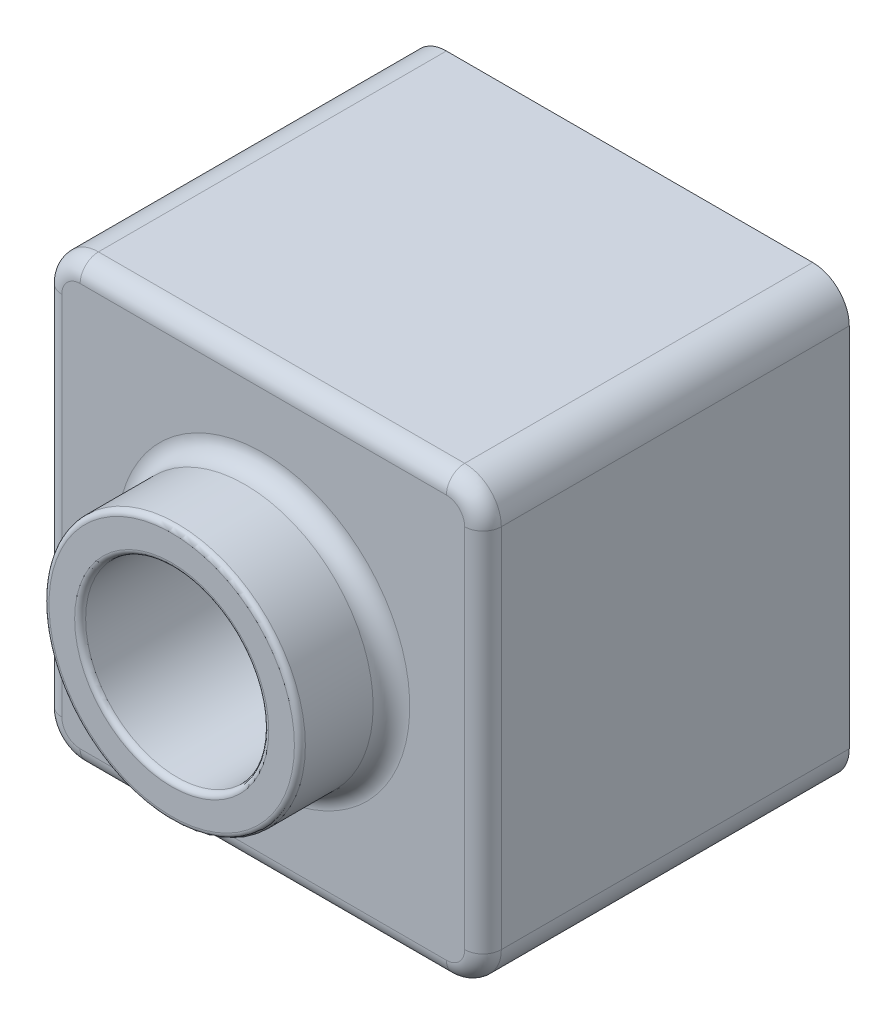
ISO-10303-21;
HEADER;
FILE_DESCRIPTION(('STEP AP214'),'2;1');
FILE_NAME('part.step','',(''),(''),'','','');
FILE_SCHEMA(('AUTOMOTIVE_DESIGN { 1 0 10303 214 1 1 1 1 }'));
ENDSEC;
DATA;
#1=APPLICATION_CONTEXT('core data for automotive mechanical design processes');
#2=APPLICATION_PROTOCOL_DEFINITION('international standard','automotive_design',2000,#1);
#3=PRODUCT_CONTEXT('',#1,'mechanical');
#4=PRODUCT('Part','Part','',(#3));
#5=PRODUCT_RELATED_PRODUCT_CATEGORY('part','',(#4));
#6=PRODUCT_DEFINITION_FORMATION('','',#4);
#7=PRODUCT_DEFINITION_CONTEXT('part definition',#1,'design');
#8=PRODUCT_DEFINITION('design','',#6,#7);
#9=PRODUCT_DEFINITION_SHAPE('','',#8);
#10=(LENGTH_UNIT() NAMED_UNIT(*) SI_UNIT(.MILLI.,.METRE.));
#11=(NAMED_UNIT(*) PLANE_ANGLE_UNIT() SI_UNIT($,.RADIAN.));
#12=(NAMED_UNIT(*) SI_UNIT($,.STERADIAN.) SOLID_ANGLE_UNIT());
#13=UNCERTAINTY_MEASURE_WITH_UNIT(LENGTH_MEASURE(1.E-05),#10,'distance_accuracy_value','');
#14=(GEOMETRIC_REPRESENTATION_CONTEXT(3) GLOBAL_UNCERTAINTY_ASSIGNED_CONTEXT((#13)) GLOBAL_UNIT_ASSIGNED_CONTEXT((#10,
#11,#12)) REPRESENTATION_CONTEXT('',''));
#15=CARTESIAN_POINT('',(0.,0.,0.));
#16=DIRECTION('',(0.,0.,1.));
#17=DIRECTION('',(1.,0.,0.));
#18=AXIS2_PLACEMENT_3D('',#15,#16,#17);
#19=CARTESIAN_POINT('',(0.,120.,0.));
#20=DIRECTION('',(0.,0.,-1.));
#21=DIRECTION('',(-1.,0.,0.));
#22=AXIS2_PLACEMENT_3D('',#19,#20,#21);
#23=PLANE('',#22);
#24=DIRECTION('',(1.,0.,0.));
#25=VECTOR('',#24,1.);
#26=CARTESIAN_POINT('',(0.,0.,0.));
#27=LINE('',#26,#25);
#28=CARTESIAN_POINT('',(10.,0.,0.));
#29=VERTEX_POINT('',#28);
#30=CARTESIAN_POINT('',(110.,0.,0.));
#31=VERTEX_POINT('',#30);
#32=EDGE_CURVE('E330',#29,#31,#27,.T.);
#33=ORIENTED_EDGE('',*,*,#32,.F.);
#34=CARTESIAN_POINT('',(10.,10.,0.));
#35=DIRECTION('',(0.,0.,-1.));
#36=DIRECTION('',(-1.,0.,0.));
#37=AXIS2_PLACEMENT_3D('',#34,#35,#36);
#38=CIRCLE('',#37,10.);
#39=CARTESIAN_POINT('',(0.,10.,0.));
#40=VERTEX_POINT('',#39);
#41=EDGE_CURVE('E350',#29,#40,#38,.T.);
#42=ORIENTED_EDGE('',*,*,#41,.T.);
#43=DIRECTION('',(0.,-1.,0.));
#44=VECTOR('',#43,1.);
#45=CARTESIAN_POINT('',(0.,0.,0.));
#46=LINE('',#45,#44);
#47=CARTESIAN_POINT('',(0.,110.,0.));
#48=VERTEX_POINT('',#47);
#49=EDGE_CURVE('E327',#48,#40,#46,.T.);
#50=ORIENTED_EDGE('',*,*,#49,.F.);
#51=CARTESIAN_POINT('',(10.,110.,0.));
#52=DIRECTION('',(0.,0.,-1.));
#53=DIRECTION('',(-1.,0.,0.));
#54=AXIS2_PLACEMENT_3D('',#51,#52,#53);
#55=CIRCLE('',#54,10.);
#56=CARTESIAN_POINT('',(10.,120.,0.));
#57=VERTEX_POINT('',#56);
#58=EDGE_CURVE('E344',#48,#57,#55,.T.);
#59=ORIENTED_EDGE('',*,*,#58,.T.);
#60=DIRECTION('',(-1.,0.,0.));
#61=VECTOR('',#60,1.);
#62=CARTESIAN_POINT('',(0.,120.,0.));
#63=LINE('',#62,#61);
#64=CARTESIAN_POINT('',(110.,120.,0.));
#65=VERTEX_POINT('',#64);
#66=EDGE_CURVE('E336',#65,#57,#63,.T.);
#67=ORIENTED_EDGE('',*,*,#66,.F.);
#68=CARTESIAN_POINT('',(110.,110.,0.));
#69=DIRECTION('',(0.,0.,-1.));
#70=DIRECTION('',(-1.,0.,0.));
#71=AXIS2_PLACEMENT_3D('',#68,#69,#70);
#72=CIRCLE('',#71,10.);
#73=CARTESIAN_POINT('',(120.,110.,0.));
#74=VERTEX_POINT('',#73);
#75=EDGE_CURVE('E346',#65,#74,#72,.T.);
#76=ORIENTED_EDGE('',*,*,#75,.T.);
#77=DIRECTION('',(0.,1.,0.));
#78=VECTOR('',#77,1.);
#79=CARTESIAN_POINT('',(120.,0.,0.));
#80=LINE('',#79,#78);
#81=CARTESIAN_POINT('',(120.,10.,0.));
#82=VERTEX_POINT('',#81);
#83=EDGE_CURVE('E333',#82,#74,#80,.T.);
#84=ORIENTED_EDGE('',*,*,#83,.F.);
#85=CARTESIAN_POINT('',(110.,10.,0.));
#86=DIRECTION('',(0.,0.,-1.));
#87=DIRECTION('',(-1.,0.,0.));
#88=AXIS2_PLACEMENT_3D('',#85,#86,#87);
#89=CIRCLE('',#88,10.);
#90=EDGE_CURVE('E348',#82,#31,#89,.T.);
#91=ORIENTED_EDGE('',*,*,#90,.T.);
#92=EDGE_LOOP('',(#33,#42,#50,#59,#67,#76,#84,#91));
#93=FACE_BOUND('',#92,.T.);
#94=CARTESIAN_POINT('',(10.,10.,0.));
#95=DIRECTION('',(0.,0.,-1.));
#96=DIRECTION('',(-1.,0.,0.));
#97=AXIS2_PLACEMENT_3D('',#94,#95,#96);
#98=CIRCLE('',#97,8.);
#99=CARTESIAN_POINT('',(10.,2.,0.));
#100=VERTEX_POINT('',#99);
#101=CARTESIAN_POINT('',(2.,10.,0.));
#102=VERTEX_POINT('',#101);
#103=EDGE_CURVE('E284',#100,#102,#98,.T.);
#104=ORIENTED_EDGE('',*,*,#103,.F.);
#105=DIRECTION('',(1.,0.,0.));
#106=VECTOR('',#105,1.);
#107=CARTESIAN_POINT('',(0.,2.,0.));
#108=LINE('',#107,#106);
#109=CARTESIAN_POINT('',(110.,2.,0.));
#110=VERTEX_POINT('',#109);
#111=EDGE_CURVE('E310',#100,#110,#108,.T.);
#112=ORIENTED_EDGE('',*,*,#111,.T.);
#113=CARTESIAN_POINT('',(110.,10.,0.));
#114=DIRECTION('',(0.,0.,-1.));
#115=DIRECTION('',(-1.,0.,0.));
#116=AXIS2_PLACEMENT_3D('',#113,#114,#115);
#117=CIRCLE('',#116,8.);
#118=CARTESIAN_POINT('',(118.,10.,0.));
#119=VERTEX_POINT('',#118);
#120=EDGE_CURVE('E314',#119,#110,#117,.T.);
#121=ORIENTED_EDGE('',*,*,#120,.F.);
#122=DIRECTION('',(0.,1.,0.));
#123=VECTOR('',#122,1.);
#124=CARTESIAN_POINT('',(118.,120.,0.));
#125=LINE('',#124,#123);
#126=CARTESIAN_POINT('',(118.,110.,0.));
#127=VERTEX_POINT('',#126);
#128=EDGE_CURVE('E52',#119,#127,#125,.T.);
#129=ORIENTED_EDGE('',*,*,#128,.T.);
#130=CARTESIAN_POINT('',(110.,110.,0.));
#131=DIRECTION('',(0.,0.,-1.));
#132=DIRECTION('',(-1.,0.,0.));
#133=AXIS2_PLACEMENT_3D('',#130,#131,#132);
#134=CIRCLE('',#133,8.);
#135=CARTESIAN_POINT('',(110.,118.,0.));
#136=VERTEX_POINT('',#135);
#137=EDGE_CURVE('E318',#136,#127,#134,.T.);
#138=ORIENTED_EDGE('',*,*,#137,.F.);
#139=DIRECTION('',(-1.,0.,0.));
#140=VECTOR('',#139,1.);
#141=CARTESIAN_POINT('',(0.,118.,0.));
#142=LINE('',#141,#140);
#143=CARTESIAN_POINT('',(10.,118.,0.));
#144=VERTEX_POINT('',#143);
#145=EDGE_CURVE('E269',#136,#144,#142,.T.);
#146=ORIENTED_EDGE('',*,*,#145,.T.);
#147=CARTESIAN_POINT('',(10.,110.,0.));
#148=DIRECTION('',(0.,0.,-1.));
#149=DIRECTION('',(-1.,0.,0.));
#150=AXIS2_PLACEMENT_3D('',#147,#148,#149);
#151=CIRCLE('',#150,8.);
#152=CARTESIAN_POINT('',(2.,110.,0.));
#153=VERTEX_POINT('',#152);
#154=EDGE_CURVE('E273',#153,#144,#151,.T.);
#155=ORIENTED_EDGE('',*,*,#154,.F.);
#156=DIRECTION('',(0.,-1.,0.));
#157=VECTOR('',#156,1.);
#158=CARTESIAN_POINT('',(2.,120.,0.));
#159=LINE('',#158,#157);
#160=EDGE_CURVE('E309',#153,#102,#159,.T.);
#161=ORIENTED_EDGE('',*,*,#160,.T.);
#162=EDGE_LOOP('',(#104,#112,#121,#129,#138,#146,#155,#161));
#163=FACE_BOUND('',#162,.T.);
#164=ADVANCED_FACE('F35',(#93,#163),#23,.T.);
#165=CARTESIAN_POINT('',(0.,120.,100.));
#166=DIRECTION('',(0.,0.,-1.));
#167=DIRECTION('',(-1.,0.,0.));
#168=AXIS2_PLACEMENT_3D('',#165,#166,#167);
#169=PLANE('',#168);
#170=CARTESIAN_POINT('',(60.,60.,100.));
#171=DIRECTION('',(0.,0.,-1.));
#172=DIRECTION('',(-1.,0.,0.));
#173=AXIS2_PLACEMENT_3D('',#170,#171,#172);
#174=CIRCLE('',#173,40.);
#175=CARTESIAN_POINT('',(20.,60.,100.));
#176=VERTEX_POINT('',#175);
#177=EDGE_CURVE('E398',#176,#176,#174,.T.);
#178=ORIENTED_EDGE('',*,*,#177,.T.);
#179=EDGE_LOOP('',(#178));
#180=FACE_BOUND('',#179,.T.);
#181=DIRECTION('',(-1.,0.,0.));
#182=VECTOR('',#181,1.);
#183=CARTESIAN_POINT('',(0.,115.,100.));
#184=LINE('',#183,#182);
#185=CARTESIAN_POINT('',(110.,115.,100.));
#186=VERTEX_POINT('',#185);
#187=CARTESIAN_POINT('',(10.,115.,100.));
#188=VERTEX_POINT('',#187);
#189=EDGE_CURVE('E393',#186,#188,#184,.T.);
#190=ORIENTED_EDGE('',*,*,#189,.T.);
#191=CARTESIAN_POINT('',(10.,110.,100.));
#192=DIRECTION('',(0.,0.,-1.));
#193=DIRECTION('',(-1.,0.,0.));
#194=AXIS2_PLACEMENT_3D('',#191,#192,#193);
#195=CIRCLE('',#194,5.);
#196=CARTESIAN_POINT('',(5.,110.,100.));
#197=VERTEX_POINT('',#196);
#198=EDGE_CURVE('E395',#188,#197,#195,.F.);
#199=ORIENTED_EDGE('',*,*,#198,.T.);
#200=DIRECTION('',(0.,-1.,0.));
#201=VECTOR('',#200,1.);
#202=CARTESIAN_POINT('',(5.,120.,100.));
#203=LINE('',#202,#201);
#204=CARTESIAN_POINT('',(5.,10.,100.));
#205=VERTEX_POINT('',#204);
#206=EDGE_CURVE('E381',#197,#205,#203,.T.);
#207=ORIENTED_EDGE('',*,*,#206,.T.);
#208=CARTESIAN_POINT('',(10.,10.,100.));
#209=DIRECTION('',(0.,0.,-1.));
#210=DIRECTION('',(-1.,0.,0.));
#211=AXIS2_PLACEMENT_3D('',#208,#209,#210);
#212=CIRCLE('',#211,5.);
#213=CARTESIAN_POINT('',(10.,5.,100.));
#214=VERTEX_POINT('',#213);
#215=EDGE_CURVE('E383',#205,#214,#212,.F.);
#216=ORIENTED_EDGE('',*,*,#215,.T.);
#217=DIRECTION('',(1.,0.,0.));
#218=VECTOR('',#217,1.);
#219=CARTESIAN_POINT('',(0.,5.,100.));
#220=LINE('',#219,#218);
#221=CARTESIAN_POINT('',(110.,5.,100.));
#222=VERTEX_POINT('',#221);
#223=EDGE_CURVE('E385',#214,#222,#220,.T.);
#224=ORIENTED_EDGE('',*,*,#223,.T.);
#225=CARTESIAN_POINT('',(110.,10.,100.));
#226=DIRECTION('',(0.,0.,-1.));
#227=DIRECTION('',(-1.,0.,0.));
#228=AXIS2_PLACEMENT_3D('',#225,#226,#227);
#229=CIRCLE('',#228,5.);
#230=CARTESIAN_POINT('',(115.,10.,100.));
#231=VERTEX_POINT('',#230);
#232=EDGE_CURVE('E387',#222,#231,#229,.F.);
#233=ORIENTED_EDGE('',*,*,#232,.T.);
#234=DIRECTION('',(0.,1.,0.));
#235=VECTOR('',#234,1.);
#236=CARTESIAN_POINT('',(115.,120.,100.));
#237=LINE('',#236,#235);
#238=CARTESIAN_POINT('',(115.,110.,100.));
#239=VERTEX_POINT('',#238);
#240=EDGE_CURVE('E389',#231,#239,#237,.T.);
#241=ORIENTED_EDGE('',*,*,#240,.T.);
#242=CARTESIAN_POINT('',(110.,110.,100.));
#243=DIRECTION('',(0.,0.,-1.));
#244=DIRECTION('',(-1.,0.,0.));
#245=AXIS2_PLACEMENT_3D('',#242,#243,#244);
#246=CIRCLE('',#245,5.);
#247=EDGE_CURVE('E391',#239,#186,#246,.F.);
#248=ORIENTED_EDGE('',*,*,#247,.T.);
#249=EDGE_LOOP('',(#190,#199,#207,#216,#224,#233,#241,#248));
#250=FACE_BOUND('',#249,.T.);
#251=ADVANCED_FACE('F478',(#180,#250),#169,.F.);
#252=CARTESIAN_POINT('',(0.,0.,100.));
#253=DIRECTION('',(1.,0.,0.));
#254=DIRECTION('',(0.,0.,-1.));
#255=AXIS2_PLACEMENT_3D('',#252,#253,#254);
#256=PLANE('',#255);
#257=DIRECTION('',(0.,0.,-1.));
#258=VECTOR('',#257,1.);
#259=CARTESIAN_POINT('',(0.,10.,100.));
#260=LINE('',#259,#258);
#261=CARTESIAN_POINT('',(0.,10.,95.));
#262=VERTEX_POINT('',#261);
#263=EDGE_CURVE('E354',#40,#262,#260,.F.);
#264=ORIENTED_EDGE('',*,*,#263,.T.);
#265=DIRECTION('',(0.,-1.,0.));
#266=VECTOR('',#265,1.);
#267=CARTESIAN_POINT('',(0.,0.,95.));
#268=LINE('',#267,#266);
#269=CARTESIAN_POINT('',(0.,110.,95.));
#270=VERTEX_POINT('',#269);
#271=EDGE_CURVE('E11',#262,#270,#268,.F.);
#272=ORIENTED_EDGE('',*,*,#271,.T.);
#273=DIRECTION('',(0.,0.,-1.));
#274=VECTOR('',#273,1.);
#275=CARTESIAN_POINT('',(0.,110.,100.));
#276=LINE('',#275,#274);
#277=EDGE_CURVE('E352',#270,#48,#276,.T.);
#278=ORIENTED_EDGE('',*,*,#277,.T.);
#279=ORIENTED_EDGE('',*,*,#49,.T.);
#280=EDGE_LOOP('',(#264,#272,#278,#279));
#281=FACE_BOUND('',#280,.T.);
#282=ADVANCED_FACE('F492',(#281),#256,.F.);
#283=CARTESIAN_POINT('',(0.,0.,100.));
#284=DIRECTION('',(0.,1.,0.));
#285=DIRECTION('',(0.,0.,1.));
#286=AXIS2_PLACEMENT_3D('',#283,#284,#285);
#287=PLANE('',#286);
#288=DIRECTION('',(0.,0.,-1.));
#289=VECTOR('',#288,1.);
#290=CARTESIAN_POINT('',(110.,0.,100.));
#291=LINE('',#290,#289);
#292=CARTESIAN_POINT('',(110.,0.,95.));
#293=VERTEX_POINT('',#292);
#294=EDGE_CURVE('E339',#31,#293,#291,.F.);
#295=ORIENTED_EDGE('',*,*,#294,.T.);
#296=DIRECTION('',(1.,0.,0.));
#297=VECTOR('',#296,1.);
#298=CARTESIAN_POINT('',(0.,0.,95.));
#299=LINE('',#298,#297);
#300=CARTESIAN_POINT('',(10.,0.,95.));
#301=VERTEX_POINT('',#300);
#302=EDGE_CURVE('E412',#293,#301,#299,.F.);
#303=ORIENTED_EDGE('',*,*,#302,.T.);
#304=DIRECTION('',(0.,0.,-1.));
#305=VECTOR('',#304,1.);
#306=CARTESIAN_POINT('',(10.,0.,100.));
#307=LINE('',#306,#305);
#308=EDGE_CURVE('E342',#301,#29,#307,.T.);
#309=ORIENTED_EDGE('',*,*,#308,.T.);
#310=ORIENTED_EDGE('',*,*,#32,.T.);
#311=EDGE_LOOP('',(#295,#303,#309,#310));
#312=FACE_BOUND('',#311,.T.);
#313=ADVANCED_FACE('F451',(#312),#287,.F.);
#314=CARTESIAN_POINT('',(120.,0.,100.));
#315=DIRECTION('',(-1.,0.,0.));
#316=DIRECTION('',(0.,0.,1.));
#317=AXIS2_PLACEMENT_3D('',#314,#315,#316);
#318=PLANE('',#317);
#319=DIRECTION('',(0.,0.,-1.));
#320=VECTOR('',#319,1.);
#321=CARTESIAN_POINT('',(120.,110.,100.));
#322=LINE('',#321,#320);
#323=CARTESIAN_POINT('',(120.,110.,95.));
#324=VERTEX_POINT('',#323);
#325=EDGE_CURVE('E356',#74,#324,#322,.F.);
#326=ORIENTED_EDGE('',*,*,#325,.T.);
#327=DIRECTION('',(0.,1.,0.));
#328=VECTOR('',#327,1.);
#329=CARTESIAN_POINT('',(120.,0.,95.));
#330=LINE('',#329,#328);
#331=CARTESIAN_POINT('',(120.,10.,95.));
#332=VERTEX_POINT('',#331);
#333=EDGE_CURVE('E408',#324,#332,#330,.F.);
#334=ORIENTED_EDGE('',*,*,#333,.T.);
#335=DIRECTION('',(0.,0.,-1.));
#336=VECTOR('',#335,1.);
#337=CARTESIAN_POINT('',(120.,10.,100.));
#338=LINE('',#337,#336);
#339=EDGE_CURVE('E359',#332,#82,#338,.T.);
#340=ORIENTED_EDGE('',*,*,#339,.T.);
#341=ORIENTED_EDGE('',*,*,#83,.T.);
#342=EDGE_LOOP('',(#326,#334,#340,#341));
#343=FACE_BOUND('',#342,.T.);
#344=ADVANCED_FACE('F462',(#343),#318,.F.);
#345=CARTESIAN_POINT('',(0.,120.,100.));
#346=DIRECTION('',(0.,-1.,0.));
#347=DIRECTION('',(0.,0.,-1.));
#348=AXIS2_PLACEMENT_3D('',#345,#346,#347);
#349=PLANE('',#348);
#350=DIRECTION('',(0.,0.,-1.));
#351=VECTOR('',#350,1.);
#352=CARTESIAN_POINT('',(10.,120.,100.));
#353=LINE('',#352,#351);
#354=CARTESIAN_POINT('',(10.,120.,95.));
#355=VERTEX_POINT('',#354);
#356=EDGE_CURVE('E361',#57,#355,#353,.F.);
#357=ORIENTED_EDGE('',*,*,#356,.T.);
#358=DIRECTION('',(-1.,0.,0.));
#359=VECTOR('',#358,1.);
#360=CARTESIAN_POINT('',(0.,120.,95.));
#361=LINE('',#360,#359);
#362=CARTESIAN_POINT('',(110.,120.,95.));
#363=VERTEX_POINT('',#362);
#364=EDGE_CURVE('E404',#355,#363,#361,.F.);
#365=ORIENTED_EDGE('',*,*,#364,.T.);
#366=DIRECTION('',(0.,0.,-1.));
#367=VECTOR('',#366,1.);
#368=CARTESIAN_POINT('',(110.,120.,100.));
#369=LINE('',#368,#367);
#370=EDGE_CURVE('E364',#363,#65,#369,.T.);
#371=ORIENTED_EDGE('',*,*,#370,.T.);
#372=ORIENTED_EDGE('',*,*,#66,.T.);
#373=EDGE_LOOP('',(#357,#365,#371,#372));
#374=FACE_BOUND('',#373,.T.);
#375=ADVANCED_FACE('F522',(#374),#349,.F.);
#376=CARTESIAN_POINT('',(60.,60.,0.));
#377=DIRECTION('',(0.,0.,-1.));
#378=DIRECTION('',(-1.,0.,0.));
#379=AXIS2_PLACEMENT_3D('',#376,#377,#378);
#380=CIRCLE('',#379,27.);
#381=CARTESIAN_POINT('',(33.,60.,0.));
#382=VERTEX_POINT('',#381);
#383=EDGE_CURVE('E264',#382,#382,#380,.F.);
#384=ORIENTED_EDGE('',*,*,#383,.F.);
#385=EDGE_LOOP('',(#384));
#386=FACE_BOUND('',#385,.T.);
#387=CARTESIAN_POINT('',(60.,60.,0.));
#388=DIRECTION('',(0.,0.,1.));
#389=DIRECTION('',(1.,0.,0.));
#390=AXIS2_PLACEMENT_3D('',#387,#388,#389);
#391=CIRCLE('',#390,25.);
#392=CARTESIAN_POINT('',(85.,60.,0.));
#393=VERTEX_POINT('',#392);
#394=EDGE_CURVE('E324',#393,#393,#391,.T.);
#395=ORIENTED_EDGE('',*,*,#394,.T.);
#396=EDGE_LOOP('',(#395));
#397=FACE_BOUND('',#396,.T.);
#398=ADVANCED_FACE('F513',(#386,#397),#23,.T.);
#399=CARTESIAN_POINT('',(60.,60.,125.));
#400=DIRECTION('',(0.,0.,-1.));
#401=DIRECTION('',(-1.,0.,0.));
#402=AXIS2_PLACEMENT_3D('',#399,#400,#401);
#403=CYLINDRICAL_SURFACE('',#402,35.);
#404=CARTESIAN_POINT('',(60.,60.,105.));
#405=DIRECTION('',(0.,0.,-1.));
#406=DIRECTION('',(-1.,0.,0.));
#407=AXIS2_PLACEMENT_3D('',#404,#405,#406);
#408=CIRCLE('',#407,35.);
#409=CARTESIAN_POINT('',(25.,60.,105.));
#410=VERTEX_POINT('',#409);
#411=EDGE_CURVE('E378',#410,#410,#408,.F.);
#412=ORIENTED_EDGE('',*,*,#411,.T.);
#413=EDGE_LOOP('',(#412));
#414=FACE_BOUND('',#413,.T.);
#415=CARTESIAN_POINT('',(60.,60.,123.5));
#416=DIRECTION('',(0.,0.,1.));
#417=DIRECTION('',(1.,0.,0.));
#418=AXIS2_PLACEMENT_3D('',#415,#416,#417);
#419=CIRCLE('',#418,35.);
#420=CARTESIAN_POINT('',(95.,60.,123.5));
#421=VERTEX_POINT('',#420);
#422=EDGE_CURVE('E372',#421,#421,#419,.F.);
#423=ORIENTED_EDGE('',*,*,#422,.T.);
#424=EDGE_LOOP('',(#423));
#425=FACE_BOUND('',#424,.T.);
#426=ADVANCED_FACE('F521',(#414,#425),#403,.T.);
#427=CARTESIAN_POINT('',(60.,60.,125.));
#428=DIRECTION('',(0.,0.,1.));
#429=DIRECTION('',(1.,0.,0.));
#430=AXIS2_PLACEMENT_3D('',#427,#428,#429);
#431=PLANE('',#430);
#432=CARTESIAN_POINT('',(60.,60.,125.));
#433=DIRECTION('',(0.,0.,1.));
#434=DIRECTION('',(1.,0.,0.));
#435=AXIS2_PLACEMENT_3D('',#432,#433,#434);
#436=CIRCLE('',#435,33.5);
#437=CARTESIAN_POINT('',(93.5,60.,125.));
#438=VERTEX_POINT('',#437);
#439=EDGE_CURVE('E369',#438,#438,#436,.T.);
#440=ORIENTED_EDGE('',*,*,#439,.T.);
#441=EDGE_LOOP('',(#440));
#442=FACE_BOUND('',#441,.T.);
#443=CARTESIAN_POINT('',(60.,60.,125.));
#444=DIRECTION('',(0.,0.,1.));
#445=DIRECTION('',(1.,0.,0.));
#446=AXIS2_PLACEMENT_3D('',#443,#444,#445);
#447=CIRCLE('',#446,26.5);
#448=CARTESIAN_POINT('',(86.5,60.,125.));
#449=VERTEX_POINT('',#448);
#450=EDGE_CURVE('E366',#449,#449,#447,.F.);
#451=ORIENTED_EDGE('',*,*,#450,.T.);
#452=EDGE_LOOP('',(#451));
#453=FACE_BOUND('',#452,.T.);
#454=ADVANCED_FACE('F528',(#442,#453),#431,.T.);
#455=CARTESIAN_POINT('',(60.,60.,0.));
#456=DIRECTION('',(0.,0.,1.));
#457=DIRECTION('',(1.,0.,0.));
#458=AXIS2_PLACEMENT_3D('',#455,#456,#457);
#459=CYLINDRICAL_SURFACE('',#458,25.);
#460=CARTESIAN_POINT('',(60.,60.,123.5));
#461=DIRECTION('',(0.,0.,1.));
#462=DIRECTION('',(1.,0.,0.));
#463=AXIS2_PLACEMENT_3D('',#460,#461,#462);
#464=CIRCLE('',#463,25.);
#465=CARTESIAN_POINT('',(85.,60.,123.5));
#466=VERTEX_POINT('',#465);
#467=EDGE_CURVE('E375',#466,#466,#464,.T.);
#468=ORIENTED_EDGE('',*,*,#467,.T.);
#469=EDGE_LOOP('',(#468));
#470=FACE_BOUND('',#469,.T.);
#471=ORIENTED_EDGE('',*,*,#394,.F.);
#472=EDGE_LOOP('',(#471));
#473=FACE_BOUND('',#472,.T.);
#474=ADVANCED_FACE('F536',(#470,#473),#459,.F.);
#475=CARTESIAN_POINT('',(10.,10.,100.));
#476=DIRECTION('',(0.,0.,-1.));
#477=DIRECTION('',(-1.,0.,0.));
#478=AXIS2_PLACEMENT_3D('',#475,#476,#477);
#479=CYLINDRICAL_SURFACE('',#478,10.);
#480=ORIENTED_EDGE('',*,*,#308,.F.);
#481=CARTESIAN_POINT('',(10.,10.,95.));
#482=DIRECTION('',(0.,0.,-1.));
#483=DIRECTION('',(-1.,0.,0.));
#484=AXIS2_PLACEMENT_3D('',#481,#482,#483);
#485=CIRCLE('',#484,10.);
#486=EDGE_CURVE('E44',#301,#262,#485,.T.);
#487=ORIENTED_EDGE('',*,*,#486,.T.);
#488=ORIENTED_EDGE('',*,*,#263,.F.);
#489=ORIENTED_EDGE('',*,*,#41,.F.);
#490=EDGE_LOOP('',(#480,#487,#488,#489));
#491=FACE_BOUND('',#490,.T.);
#492=ADVANCED_FACE('F538',(#491),#479,.T.);
#493=CARTESIAN_POINT('',(110.,10.,100.));
#494=DIRECTION('',(0.,0.,-1.));
#495=DIRECTION('',(-1.,0.,0.));
#496=AXIS2_PLACEMENT_3D('',#493,#494,#495);
#497=CYLINDRICAL_SURFACE('',#496,10.);
#498=ORIENTED_EDGE('',*,*,#339,.F.);
#499=CARTESIAN_POINT('',(110.,10.,95.));
#500=DIRECTION('',(0.,0.,-1.));
#501=DIRECTION('',(-1.,0.,0.));
#502=AXIS2_PLACEMENT_3D('',#499,#500,#501);
#503=CIRCLE('',#502,10.);
#504=EDGE_CURVE('E410',#332,#293,#503,.T.);
#505=ORIENTED_EDGE('',*,*,#504,.T.);
#506=ORIENTED_EDGE('',*,*,#294,.F.);
#507=ORIENTED_EDGE('',*,*,#90,.F.);
#508=EDGE_LOOP('',(#498,#505,#506,#507));
#509=FACE_BOUND('',#508,.T.);
#510=ADVANCED_FACE('F448',(#509),#497,.T.);
#511=CARTESIAN_POINT('',(110.,110.,100.));
#512=DIRECTION('',(0.,0.,-1.));
#513=DIRECTION('',(-1.,0.,0.));
#514=AXIS2_PLACEMENT_3D('',#511,#512,#513);
#515=CYLINDRICAL_SURFACE('',#514,10.);
#516=ORIENTED_EDGE('',*,*,#370,.F.);
#517=CARTESIAN_POINT('',(110.,110.,95.));
#518=DIRECTION('',(0.,0.,-1.));
#519=DIRECTION('',(-1.,0.,0.));
#520=AXIS2_PLACEMENT_3D('',#517,#518,#519);
#521=CIRCLE('',#520,10.);
#522=EDGE_CURVE('E406',#363,#324,#521,.T.);
#523=ORIENTED_EDGE('',*,*,#522,.T.);
#524=ORIENTED_EDGE('',*,*,#325,.F.);
#525=ORIENTED_EDGE('',*,*,#75,.F.);
#526=EDGE_LOOP('',(#516,#523,#524,#525));
#527=FACE_BOUND('',#526,.T.);
#528=ADVANCED_FACE('F465',(#527),#515,.T.);
#529=CARTESIAN_POINT('',(10.,110.,100.));
#530=DIRECTION('',(0.,0.,-1.));
#531=DIRECTION('',(-1.,0.,0.));
#532=AXIS2_PLACEMENT_3D('',#529,#530,#531);
#533=CYLINDRICAL_SURFACE('',#532,10.);
#534=ORIENTED_EDGE('',*,*,#277,.F.);
#535=CARTESIAN_POINT('',(10.,110.,95.));
#536=DIRECTION('',(0.,0.,-1.));
#537=DIRECTION('',(-1.,0.,0.));
#538=AXIS2_PLACEMENT_3D('',#535,#536,#537);
#539=CIRCLE('',#538,10.);
#540=EDGE_CURVE('E401',#270,#355,#539,.T.);
#541=ORIENTED_EDGE('',*,*,#540,.T.);
#542=ORIENTED_EDGE('',*,*,#356,.F.);
#543=ORIENTED_EDGE('',*,*,#58,.F.);
#544=EDGE_LOOP('',(#534,#541,#542,#543));
#545=FACE_BOUND('',#544,.T.);
#546=ADVANCED_FACE('F496',(#545),#533,.T.);
#547=CARTESIAN_POINT('',(60.,60.,123.5));
#548=DIRECTION('',(0.,0.,1.));
#549=DIRECTION('',(1.,0.,0.));
#550=AXIS2_PLACEMENT_3D('',#547,#548,#549);
#551=TOROIDAL_SURFACE('',#550,33.5,1.5);
#552=ORIENTED_EDGE('',*,*,#422,.F.);
#553=EDGE_LOOP('',(#552));
#554=FACE_BOUND('',#553,.T.);
#555=ORIENTED_EDGE('',*,*,#439,.F.);
#556=EDGE_LOOP('',(#555));
#557=FACE_BOUND('',#556,.T.);
#558=ADVANCED_FACE('F877',(#554,#557),#551,.T.);
#559=CARTESIAN_POINT('',(60.,60.,123.5));
#560=DIRECTION('',(0.,0.,1.));
#561=DIRECTION('',(1.,0.,0.));
#562=AXIS2_PLACEMENT_3D('',#559,#560,#561);
#563=TOROIDAL_SURFACE('',#562,26.5,1.5);
#564=ORIENTED_EDGE('',*,*,#450,.F.);
#565=EDGE_LOOP('',(#564));
#566=FACE_BOUND('',#565,.T.);
#567=ORIENTED_EDGE('',*,*,#467,.F.);
#568=EDGE_LOOP('',(#567));
#569=FACE_BOUND('',#568,.T.);
#570=ADVANCED_FACE('F868',(#566,#569),#563,.T.);
#571=CARTESIAN_POINT('',(60.,60.,105.));
#572=DIRECTION('',(0.,0.,-1.));
#573=DIRECTION('',(-1.,0.,0.));
#574=AXIS2_PLACEMENT_3D('',#571,#572,#573);
#575=TOROIDAL_SURFACE('',#574,40.,5.);
#576=ORIENTED_EDGE('',*,*,#177,.F.);
#577=EDGE_LOOP('',(#576));
#578=FACE_BOUND('',#577,.T.);
#579=ORIENTED_EDGE('',*,*,#411,.F.);
#580=EDGE_LOOP('',(#579));
#581=FACE_BOUND('',#580,.T.);
#582=ADVANCED_FACE('F860',(#578,#581),#575,.F.);
#583=CARTESIAN_POINT('',(110.,10.,95.));
#584=DIRECTION('',(0.,0.,-1.));
#585=DIRECTION('',(-1.,0.,0.));
#586=AXIS2_PLACEMENT_3D('',#583,#584,#585);
#587=DEGENERATE_TOROIDAL_SURFACE('',#586,5.,5.,.T.);
#588=CARTESIAN_POINT('',(110.,5.,95.));
#589=DIRECTION('',(-1.,0.,0.));
#590=DIRECTION('',(0.,0.,1.));
#591=AXIS2_PLACEMENT_3D('',#588,#589,#590);
#592=CIRCLE('',#591,5.);
#593=EDGE_CURVE('E429',#293,#222,#592,.T.);
#594=ORIENTED_EDGE('',*,*,#593,.F.);
#595=ORIENTED_EDGE('',*,*,#504,.F.);
#596=CARTESIAN_POINT('',(115.,10.,95.));
#597=DIRECTION('',(0.,1.,0.));
#598=DIRECTION('',(0.,0.,1.));
#599=AXIS2_PLACEMENT_3D('',#596,#597,#598);
#600=CIRCLE('',#599,5.);
#601=EDGE_CURVE('E39',#231,#332,#600,.T.);
#602=ORIENTED_EDGE('',*,*,#601,.F.);
#603=ORIENTED_EDGE('',*,*,#232,.F.);
#604=EDGE_LOOP('',(#594,#595,#602,#603));
#605=FACE_BOUND('',#604,.T.);
#606=ADVANCED_FACE('F37',(#605),#587,.T.);
#607=CARTESIAN_POINT('',(115.,120.,95.));
#608=DIRECTION('',(0.,1.,0.));
#609=DIRECTION('',(0.,0.,1.));
#610=AXIS2_PLACEMENT_3D('',#607,#608,#609);
#611=CYLINDRICAL_SURFACE('',#610,5.);
#612=ORIENTED_EDGE('',*,*,#601,.T.);
#613=ORIENTED_EDGE('',*,*,#333,.F.);
#614=CARTESIAN_POINT('',(115.,110.,95.));
#615=DIRECTION('',(0.,1.,0.));
#616=DIRECTION('',(0.,0.,1.));
#617=AXIS2_PLACEMENT_3D('',#614,#615,#616);
#618=CIRCLE('',#617,5.);
#619=EDGE_CURVE('E427',#239,#324,#618,.T.);
#620=ORIENTED_EDGE('',*,*,#619,.F.);
#621=ORIENTED_EDGE('',*,*,#240,.F.);
#622=EDGE_LOOP('',(#612,#613,#620,#621));
#623=FACE_BOUND('',#622,.T.);
#624=ADVANCED_FACE('F440',(#623),#611,.T.);
#625=CARTESIAN_POINT('',(0.,5.,95.));
#626=DIRECTION('',(1.,0.,0.));
#627=DIRECTION('',(0.,0.,-1.));
#628=AXIS2_PLACEMENT_3D('',#625,#626,#627);
#629=CYLINDRICAL_SURFACE('',#628,5.);
#630=ORIENTED_EDGE('',*,*,#593,.T.);
#631=ORIENTED_EDGE('',*,*,#223,.F.);
#632=CARTESIAN_POINT('',(10.,5.,95.));
#633=DIRECTION('',(-1.,0.,0.));
#634=DIRECTION('',(0.,0.,1.));
#635=AXIS2_PLACEMENT_3D('',#632,#633,#634);
#636=CIRCLE('',#635,5.);
#637=EDGE_CURVE('E424',#301,#214,#636,.T.);
#638=ORIENTED_EDGE('',*,*,#637,.F.);
#639=ORIENTED_EDGE('',*,*,#302,.F.);
#640=EDGE_LOOP('',(#630,#631,#638,#639));
#641=FACE_BOUND('',#640,.T.);
#642=ADVANCED_FACE('F481',(#641),#629,.T.);
#643=CARTESIAN_POINT('',(110.,110.,95.));
#644=DIRECTION('',(0.,0.,-1.));
#645=DIRECTION('',(-1.,0.,0.));
#646=AXIS2_PLACEMENT_3D('',#643,#644,#645);
#647=DEGENERATE_TOROIDAL_SURFACE('',#646,5.,5.,.T.);
#648=ORIENTED_EDGE('',*,*,#619,.T.);
#649=ORIENTED_EDGE('',*,*,#522,.F.);
#650=CARTESIAN_POINT('',(110.,115.,95.));
#651=DIRECTION('',(-1.,0.,0.));
#652=DIRECTION('',(0.,0.,1.));
#653=AXIS2_PLACEMENT_3D('',#650,#651,#652);
#654=CIRCLE('',#653,5.);
#655=EDGE_CURVE('E421',#186,#363,#654,.T.);
#656=ORIENTED_EDGE('',*,*,#655,.F.);
#657=ORIENTED_EDGE('',*,*,#247,.F.);
#658=EDGE_LOOP('',(#648,#649,#656,#657));
#659=FACE_BOUND('',#658,.T.);
#660=ADVANCED_FACE('F469',(#659),#647,.T.);
#661=CARTESIAN_POINT('',(10.,10.,95.));
#662=DIRECTION('',(0.,0.,-1.));
#663=DIRECTION('',(-1.,0.,0.));
#664=AXIS2_PLACEMENT_3D('',#661,#662,#663);
#665=DEGENERATE_TOROIDAL_SURFACE('',#664,5.,5.,.T.);
#666=ORIENTED_EDGE('',*,*,#637,.T.);
#667=ORIENTED_EDGE('',*,*,#215,.F.);
#668=CARTESIAN_POINT('',(5.,10.,95.));
#669=DIRECTION('',(0.,1.,0.));
#670=DIRECTION('',(0.,0.,1.));
#671=AXIS2_PLACEMENT_3D('',#668,#669,#670);
#672=CIRCLE('',#671,5.);
#673=EDGE_CURVE('E418',#262,#205,#672,.T.);
#674=ORIENTED_EDGE('',*,*,#673,.F.);
#675=ORIENTED_EDGE('',*,*,#486,.F.);
#676=EDGE_LOOP('',(#666,#667,#674,#675));
#677=FACE_BOUND('',#676,.T.);
#678=ADVANCED_FACE('F483',(#677),#665,.T.);
#679=CARTESIAN_POINT('',(0.,115.,95.));
#680=DIRECTION('',(-1.,0.,0.));
#681=DIRECTION('',(0.,0.,1.));
#682=AXIS2_PLACEMENT_3D('',#679,#680,#681);
#683=CYLINDRICAL_SURFACE('',#682,5.);
#684=ORIENTED_EDGE('',*,*,#655,.T.);
#685=ORIENTED_EDGE('',*,*,#364,.F.);
#686=CARTESIAN_POINT('',(10.,115.,95.));
#687=DIRECTION('',(-1.,0.,0.));
#688=DIRECTION('',(0.,0.,1.));
#689=AXIS2_PLACEMENT_3D('',#686,#687,#688);
#690=CIRCLE('',#689,5.);
#691=EDGE_CURVE('E416',#188,#355,#690,.T.);
#692=ORIENTED_EDGE('',*,*,#691,.F.);
#693=ORIENTED_EDGE('',*,*,#189,.F.);
#694=EDGE_LOOP('',(#684,#685,#692,#693));
#695=FACE_BOUND('',#694,.T.);
#696=ADVANCED_FACE('F474',(#695),#683,.T.);
#697=CARTESIAN_POINT('',(5.,120.,95.));
#698=DIRECTION('',(0.,-1.,0.));
#699=DIRECTION('',(0.,0.,-1.));
#700=AXIS2_PLACEMENT_3D('',#697,#698,#699);
#701=CYLINDRICAL_SURFACE('',#700,5.);
#702=ORIENTED_EDGE('',*,*,#673,.T.);
#703=ORIENTED_EDGE('',*,*,#206,.F.);
#704=CARTESIAN_POINT('',(5.,110.,95.));
#705=DIRECTION('',(0.,1.,0.));
#706=DIRECTION('',(0.,0.,1.));
#707=AXIS2_PLACEMENT_3D('',#704,#705,#706);
#708=CIRCLE('',#707,5.);
#709=EDGE_CURVE('E282',#270,#197,#708,.T.);
#710=ORIENTED_EDGE('',*,*,#709,.F.);
#711=ORIENTED_EDGE('',*,*,#271,.F.);
#712=EDGE_LOOP('',(#702,#703,#710,#711));
#713=FACE_BOUND('',#712,.T.);
#714=ADVANCED_FACE('F489',(#713),#701,.T.);
#715=CARTESIAN_POINT('',(10.,110.,95.));
#716=DIRECTION('',(0.,0.,-1.));
#717=DIRECTION('',(-1.,0.,0.));
#718=AXIS2_PLACEMENT_3D('',#715,#716,#717);
#719=DEGENERATE_TOROIDAL_SURFACE('',#718,5.,5.,.T.);
#720=ORIENTED_EDGE('',*,*,#691,.T.);
#721=ORIENTED_EDGE('',*,*,#540,.F.);
#722=ORIENTED_EDGE('',*,*,#709,.T.);
#723=ORIENTED_EDGE('',*,*,#198,.F.);
#724=EDGE_LOOP('',(#720,#721,#722,#723));
#725=FACE_BOUND('',#724,.T.);
#726=ADVANCED_FACE('F499',(#725),#719,.T.);
#727=CARTESIAN_POINT('',(0.,120.,98.));
#728=DIRECTION('',(0.,0.,-1.));
#729=DIRECTION('',(-1.,0.,0.));
#730=AXIS2_PLACEMENT_3D('',#727,#728,#729);
#731=PLANE('',#730);
#732=CARTESIAN_POINT('',(60.,60.,98.));
#733=DIRECTION('',(0.,0.,-1.));
#734=DIRECTION('',(-1.,0.,0.));
#735=AXIS2_PLACEMENT_3D('',#732,#733,#734);
#736=CIRCLE('',#735,40.);
#737=CARTESIAN_POINT('',(20.,60.,98.));
#738=VERTEX_POINT('',#737);
#739=EDGE_CURVE('E228',#738,#738,#736,.T.);
#740=ORIENTED_EDGE('',*,*,#739,.F.);
#741=EDGE_LOOP('',(#740));
#742=FACE_BOUND('',#741,.T.);
#743=DIRECTION('',(-1.,0.,0.));
#744=VECTOR('',#743,1.);
#745=CARTESIAN_POINT('',(0.,115.,98.));
#746=LINE('',#745,#744);
#747=CARTESIAN_POINT('',(110.,115.,98.));
#748=VERTEX_POINT('',#747);
#749=CARTESIAN_POINT('',(10.,115.,98.));
#750=VERTEX_POINT('',#749);
#751=EDGE_CURVE('E200',#748,#750,#746,.T.);
#752=ORIENTED_EDGE('',*,*,#751,.F.);
#753=CARTESIAN_POINT('',(110.,110.,98.));
#754=DIRECTION('',(0.,0.,-1.));
#755=DIRECTION('',(-1.,0.,0.));
#756=AXIS2_PLACEMENT_3D('',#753,#754,#755);
#757=CIRCLE('',#756,5.);
#758=CARTESIAN_POINT('',(115.,110.,98.));
#759=VERTEX_POINT('',#758);
#760=EDGE_CURVE('E211',#759,#748,#757,.F.);
#761=ORIENTED_EDGE('',*,*,#760,.F.);
#762=DIRECTION('',(0.,1.,0.));
#763=VECTOR('',#762,1.);
#764=CARTESIAN_POINT('',(115.,120.,98.));
#765=LINE('',#764,#763);
#766=CARTESIAN_POINT('',(115.,9.99999999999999,98.));
#767=VERTEX_POINT('',#766);
#768=EDGE_CURVE('E241',#767,#759,#765,.T.);
#769=ORIENTED_EDGE('',*,*,#768,.F.);
#770=CARTESIAN_POINT('',(110.,10.,98.));
#771=DIRECTION('',(0.,0.,-1.));
#772=DIRECTION('',(-1.,0.,0.));
#773=AXIS2_PLACEMENT_3D('',#770,#771,#772);
#774=CIRCLE('',#773,5.);
#775=CARTESIAN_POINT('',(110.,5.,98.));
#776=VERTEX_POINT('',#775);
#777=EDGE_CURVE('E239',#776,#767,#774,.F.);
#778=ORIENTED_EDGE('',*,*,#777,.F.);
#779=DIRECTION('',(-1.,0.,0.));
#780=VECTOR('',#779,1.);
#781=CARTESIAN_POINT('',(0.,5.,98.));
#782=LINE('',#781,#780);
#783=CARTESIAN_POINT('',(10.,5.,98.));
#784=VERTEX_POINT('',#783);
#785=EDGE_CURVE('E237',#784,#776,#782,.F.);
#786=ORIENTED_EDGE('',*,*,#785,.F.);
#787=CARTESIAN_POINT('',(10.,10.,98.));
#788=DIRECTION('',(0.,0.,-1.));
#789=DIRECTION('',(-1.,0.,0.));
#790=AXIS2_PLACEMENT_3D('',#787,#788,#789);
#791=CIRCLE('',#790,5.);
#792=CARTESIAN_POINT('',(5.,9.99999999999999,98.));
#793=VERTEX_POINT('',#792);
#794=EDGE_CURVE('E234',#793,#784,#791,.F.);
#795=ORIENTED_EDGE('',*,*,#794,.F.);
#796=DIRECTION('',(0.,1.,0.));
#797=VECTOR('',#796,1.);
#798=CARTESIAN_POINT('',(5.,120.,98.));
#799=LINE('',#798,#797);
#800=CARTESIAN_POINT('',(5.,110.,98.));
#801=VERTEX_POINT('',#800);
#802=EDGE_CURVE('E227',#801,#793,#799,.F.);
#803=ORIENTED_EDGE('',*,*,#802,.F.);
#804=CARTESIAN_POINT('',(10.,110.,98.));
#805=DIRECTION('',(0.,0.,-1.));
#806=DIRECTION('',(-1.,0.,0.));
#807=AXIS2_PLACEMENT_3D('',#804,#805,#806);
#808=CIRCLE('',#807,5.);
#809=EDGE_CURVE('E210',#750,#801,#808,.F.);
#810=ORIENTED_EDGE('',*,*,#809,.F.);
#811=EDGE_LOOP('',(#752,#761,#769,#778,#786,#795,#803,#810));
#812=FACE_BOUND('',#811,.T.);
#813=ADVANCED_FACE('F225',(#742,#812),#731,.T.);
#814=CARTESIAN_POINT('',(2.,0.,100.));
#815=DIRECTION('',(1.,0.,0.));
#816=DIRECTION('',(0.,0.,-1.));
#817=AXIS2_PLACEMENT_3D('',#814,#815,#816);
#818=PLANE('',#817);
#819=DIRECTION('',(0.,0.,-1.));
#820=VECTOR('',#819,1.);
#821=CARTESIAN_POINT('',(2.,10.,100.));
#822=LINE('',#821,#820);
#823=CARTESIAN_POINT('',(2.,10.,95.));
#824=VERTEX_POINT('',#823);
#825=EDGE_CURVE('E276',#102,#824,#822,.F.);
#826=ORIENTED_EDGE('',*,*,#825,.F.);
#827=ORIENTED_EDGE('',*,*,#160,.F.);
#828=DIRECTION('',(0.,0.,-1.));
#829=VECTOR('',#828,1.);
#830=CARTESIAN_POINT('',(2.,110.,100.));
#831=LINE('',#830,#829);
#832=CARTESIAN_POINT('',(2.,110.,95.));
#833=VERTEX_POINT('',#832);
#834=EDGE_CURVE('E280',#833,#153,#831,.T.);
#835=ORIENTED_EDGE('',*,*,#834,.F.);
#836=DIRECTION('',(0.,1.,0.));
#837=VECTOR('',#836,1.);
#838=CARTESIAN_POINT('',(2.,0.,95.));
#839=LINE('',#838,#837);
#840=EDGE_CURVE('E275',#824,#833,#839,.T.);
#841=ORIENTED_EDGE('',*,*,#840,.F.);
#842=EDGE_LOOP('',(#826,#827,#835,#841));
#843=FACE_BOUND('',#842,.T.);
#844=ADVANCED_FACE('F506',(#843),#818,.T.);
#845=CARTESIAN_POINT('',(0.,2.,100.));
#846=DIRECTION('',(0.,1.,0.));
#847=DIRECTION('',(0.,0.,1.));
#848=AXIS2_PLACEMENT_3D('',#845,#846,#847);
#849=PLANE('',#848);
#850=DIRECTION('',(0.,0.,1.));
#851=VECTOR('',#850,1.);
#852=CARTESIAN_POINT('',(110.,2.,100.));
#853=LINE('',#852,#851);
#854=CARTESIAN_POINT('',(110.,2.,95.));
#855=VERTEX_POINT('',#854);
#856=EDGE_CURVE('E265',#110,#855,#853,.T.);
#857=ORIENTED_EDGE('',*,*,#856,.F.);
#858=ORIENTED_EDGE('',*,*,#111,.F.);
#859=DIRECTION('',(0.,0.,1.));
#860=VECTOR('',#859,1.);
#861=CARTESIAN_POINT('',(10.,2.,100.));
#862=LINE('',#861,#860);
#863=CARTESIAN_POINT('',(10.,2.,95.));
#864=VERTEX_POINT('',#863);
#865=EDGE_CURVE('E268',#864,#100,#862,.F.);
#866=ORIENTED_EDGE('',*,*,#865,.F.);
#867=DIRECTION('',(1.,0.,0.));
#868=VECTOR('',#867,1.);
#869=CARTESIAN_POINT('',(0.,2.,95.));
#870=LINE('',#869,#868);
#871=EDGE_CURVE('E260',#855,#864,#870,.F.);
#872=ORIENTED_EDGE('',*,*,#871,.F.);
#873=EDGE_LOOP('',(#857,#858,#866,#872));
#874=FACE_BOUND('',#873,.T.);
#875=ADVANCED_FACE('F616',(#874),#849,.T.);
#876=CARTESIAN_POINT('',(118.,0.,100.));
#877=DIRECTION('',(-1.,0.,0.));
#878=DIRECTION('',(0.,0.,1.));
#879=AXIS2_PLACEMENT_3D('',#876,#877,#878);
#880=PLANE('',#879);
#881=DIRECTION('',(0.,0.,1.));
#882=VECTOR('',#881,1.);
#883=CARTESIAN_POINT('',(118.,110.,100.));
#884=LINE('',#883,#882);
#885=CARTESIAN_POINT('',(118.,110.,95.));
#886=VERTEX_POINT('',#885);
#887=EDGE_CURVE('E279',#127,#886,#884,.T.);
#888=ORIENTED_EDGE('',*,*,#887,.F.);
#889=ORIENTED_EDGE('',*,*,#128,.F.);
#890=DIRECTION('',(0.,0.,1.));
#891=VECTOR('',#890,1.);
#892=CARTESIAN_POINT('',(118.,10.,100.));
#893=LINE('',#892,#891);
#894=CARTESIAN_POINT('',(118.,10.,95.));
#895=VERTEX_POINT('',#894);
#896=EDGE_CURVE('E289',#895,#119,#893,.F.);
#897=ORIENTED_EDGE('',*,*,#896,.F.);
#898=DIRECTION('',(0.,1.,0.));
#899=VECTOR('',#898,1.);
#900=CARTESIAN_POINT('',(118.,0.,95.));
#901=LINE('',#900,#899);
#902=EDGE_CURVE('E261',#886,#895,#901,.F.);
#903=ORIENTED_EDGE('',*,*,#902,.F.);
#904=EDGE_LOOP('',(#888,#889,#897,#903));
#905=FACE_BOUND('',#904,.T.);
#906=ADVANCED_FACE('F612',(#905),#880,.T.);
#907=CARTESIAN_POINT('',(0.,118.,100.));
#908=DIRECTION('',(0.,-1.,0.));
#909=DIRECTION('',(0.,0.,-1.));
#910=AXIS2_PLACEMENT_3D('',#907,#908,#909);
#911=PLANE('',#910);
#912=DIRECTION('',(0.,0.,-1.));
#913=VECTOR('',#912,1.);
#914=CARTESIAN_POINT('',(10.,118.,100.));
#915=LINE('',#914,#913);
#916=CARTESIAN_POINT('',(10.,118.,95.));
#917=VERTEX_POINT('',#916);
#918=EDGE_CURVE('E287',#144,#917,#915,.F.);
#919=ORIENTED_EDGE('',*,*,#918,.F.);
#920=ORIENTED_EDGE('',*,*,#145,.F.);
#921=DIRECTION('',(0.,0.,-1.));
#922=VECTOR('',#921,1.);
#923=CARTESIAN_POINT('',(110.,118.,100.));
#924=LINE('',#923,#922);
#925=CARTESIAN_POINT('',(110.,118.,95.));
#926=VERTEX_POINT('',#925);
#927=EDGE_CURVE('E250',#926,#136,#924,.T.);
#928=ORIENTED_EDGE('',*,*,#927,.F.);
#929=DIRECTION('',(1.,0.,0.));
#930=VECTOR('',#929,1.);
#931=CARTESIAN_POINT('',(0.,118.,95.));
#932=LINE('',#931,#930);
#933=EDGE_CURVE('E286',#917,#926,#932,.T.);
#934=ORIENTED_EDGE('',*,*,#933,.F.);
#935=EDGE_LOOP('',(#919,#920,#928,#934));
#936=FACE_BOUND('',#935,.T.);
#937=ADVANCED_FACE('F608',(#936),#911,.T.);
#938=CARTESIAN_POINT('',(60.,60.,125.));
#939=DIRECTION('',(0.,0.,-1.));
#940=DIRECTION('',(-1.,0.,0.));
#941=AXIS2_PLACEMENT_3D('',#938,#939,#940);
#942=CYLINDRICAL_SURFACE('',#941,33.);
#943=CARTESIAN_POINT('',(60.,60.,105.));
#944=DIRECTION('',(0.,0.,-1.));
#945=DIRECTION('',(-1.,0.,0.));
#946=AXIS2_PLACEMENT_3D('',#943,#944,#945);
#947=CIRCLE('',#946,33.);
#948=CARTESIAN_POINT('',(27.,60.,105.));
#949=VERTEX_POINT('',#948);
#950=EDGE_CURVE('E235',#949,#949,#947,.F.);
#951=ORIENTED_EDGE('',*,*,#950,.F.);
#952=EDGE_LOOP('',(#951));
#953=FACE_BOUND('',#952,.T.);
#954=CARTESIAN_POINT('',(60.,60.,123.));
#955=DIRECTION('',(0.,0.,1.));
#956=DIRECTION('',(1.,0.,0.));
#957=AXIS2_PLACEMENT_3D('',#954,#955,#956);
#958=CIRCLE('',#957,33.);
#959=CARTESIAN_POINT('',(93.,60.,123.));
#960=VERTEX_POINT('',#959);
#961=EDGE_CURVE('E247',#960,#960,#958,.T.);
#962=ORIENTED_EDGE('',*,*,#961,.T.);
#963=EDGE_LOOP('',(#962));
#964=FACE_BOUND('',#963,.T.);
#965=ADVANCED_FACE('F604',(#953,#964),#942,.F.);
#966=CARTESIAN_POINT('',(60.,60.,123.));
#967=DIRECTION('',(0.,0.,1.));
#968=DIRECTION('',(1.,0.,0.));
#969=AXIS2_PLACEMENT_3D('',#966,#967,#968);
#970=PLANE('',#969);
#971=ORIENTED_EDGE('',*,*,#961,.F.);
#972=EDGE_LOOP('',(#971));
#973=FACE_BOUND('',#972,.T.);
#974=CARTESIAN_POINT('',(60.,60.,123.));
#975=DIRECTION('',(0.,0.,1.));
#976=DIRECTION('',(1.,0.,0.));
#977=AXIS2_PLACEMENT_3D('',#974,#975,#976);
#978=CIRCLE('',#977,27.);
#979=CARTESIAN_POINT('',(87.,60.,123.));
#980=VERTEX_POINT('',#979);
#981=EDGE_CURVE('E246',#980,#980,#978,.T.);
#982=ORIENTED_EDGE('',*,*,#981,.T.);
#983=EDGE_LOOP('',(#982));
#984=FACE_BOUND('',#983,.T.);
#985=ADVANCED_FACE('F600',(#973,#984),#970,.F.);
#986=CARTESIAN_POINT('',(60.,60.,0.));
#987=DIRECTION('',(0.,0.,1.));
#988=DIRECTION('',(1.,0.,0.));
#989=AXIS2_PLACEMENT_3D('',#986,#987,#988);
#990=CYLINDRICAL_SURFACE('',#989,27.);
#991=ORIENTED_EDGE('',*,*,#981,.F.);
#992=EDGE_LOOP('',(#991));
#993=FACE_BOUND('',#992,.T.);
#994=ORIENTED_EDGE('',*,*,#383,.T.);
#995=EDGE_LOOP('',(#994));
#996=FACE_BOUND('',#995,.T.);
#997=ADVANCED_FACE('F596',(#993,#996),#990,.T.);
#998=CARTESIAN_POINT('',(10.,10.,100.));
#999=DIRECTION('',(0.,0.,-1.));
#1000=DIRECTION('',(-1.,0.,0.));
#1001=AXIS2_PLACEMENT_3D('',#998,#999,#1000);
#1002=CYLINDRICAL_SURFACE('',#1001,8.);
#1003=ORIENTED_EDGE('',*,*,#865,.T.);
#1004=ORIENTED_EDGE('',*,*,#103,.T.);
#1005=ORIENTED_EDGE('',*,*,#825,.T.);
#1006=CARTESIAN_POINT('',(10.,10.,95.));
#1007=DIRECTION('',(0.,0.,-1.));
#1008=DIRECTION('',(-1.,0.,0.));
#1009=AXIS2_PLACEMENT_3D('',#1006,#1007,#1008);
#1010=CIRCLE('',#1009,8.);
#1011=EDGE_CURVE('E271',#864,#824,#1010,.T.);
#1012=ORIENTED_EDGE('',*,*,#1011,.F.);
#1013=EDGE_LOOP('',(#1003,#1004,#1005,#1012));
#1014=FACE_BOUND('',#1013,.T.);
#1015=ADVANCED_FACE('F592',(#1014),#1002,.F.);
#1016=CARTESIAN_POINT('',(110.,10.,100.));
#1017=DIRECTION('',(0.,0.,-1.));
#1018=DIRECTION('',(-1.,0.,0.));
#1019=AXIS2_PLACEMENT_3D('',#1016,#1017,#1018);
#1020=CYLINDRICAL_SURFACE('',#1019,8.);
#1021=ORIENTED_EDGE('',*,*,#896,.T.);
#1022=ORIENTED_EDGE('',*,*,#120,.T.);
#1023=ORIENTED_EDGE('',*,*,#856,.T.);
#1024=CARTESIAN_POINT('',(110.,10.,95.));
#1025=DIRECTION('',(0.,0.,-1.));
#1026=DIRECTION('',(-1.,0.,0.));
#1027=AXIS2_PLACEMENT_3D('',#1024,#1025,#1026);
#1028=CIRCLE('',#1027,8.);
#1029=EDGE_CURVE('E258',#895,#855,#1028,.T.);
#1030=ORIENTED_EDGE('',*,*,#1029,.F.);
#1031=EDGE_LOOP('',(#1021,#1022,#1023,#1030));
#1032=FACE_BOUND('',#1031,.T.);
#1033=ADVANCED_FACE('F588',(#1032),#1020,.F.);
#1034=CARTESIAN_POINT('',(110.,110.,100.));
#1035=DIRECTION('',(0.,0.,-1.));
#1036=DIRECTION('',(-1.,0.,0.));
#1037=AXIS2_PLACEMENT_3D('',#1034,#1035,#1036);
#1038=CYLINDRICAL_SURFACE('',#1037,8.);
#1039=ORIENTED_EDGE('',*,*,#927,.T.);
#1040=ORIENTED_EDGE('',*,*,#137,.T.);
#1041=ORIENTED_EDGE('',*,*,#887,.T.);
#1042=CARTESIAN_POINT('',(110.,110.,95.));
#1043=DIRECTION('',(0.,0.,-1.));
#1044=DIRECTION('',(-1.,0.,0.));
#1045=AXIS2_PLACEMENT_3D('',#1042,#1043,#1044);
#1046=CIRCLE('',#1045,8.);
#1047=EDGE_CURVE('E291',#926,#886,#1046,.T.);
#1048=ORIENTED_EDGE('',*,*,#1047,.F.);
#1049=EDGE_LOOP('',(#1039,#1040,#1041,#1048));
#1050=FACE_BOUND('',#1049,.T.);
#1051=ADVANCED_FACE('F584',(#1050),#1038,.F.);
#1052=CARTESIAN_POINT('',(10.,110.,100.));
#1053=DIRECTION('',(0.,0.,-1.));
#1054=DIRECTION('',(-1.,0.,0.));
#1055=AXIS2_PLACEMENT_3D('',#1052,#1053,#1054);
#1056=CYLINDRICAL_SURFACE('',#1055,8.);
#1057=ORIENTED_EDGE('',*,*,#834,.T.);
#1058=ORIENTED_EDGE('',*,*,#154,.T.);
#1059=ORIENTED_EDGE('',*,*,#918,.T.);
#1060=CARTESIAN_POINT('',(10.,110.,95.));
#1061=DIRECTION('',(0.,0.,-1.));
#1062=DIRECTION('',(-1.,0.,0.));
#1063=AXIS2_PLACEMENT_3D('',#1060,#1061,#1062);
#1064=CIRCLE('',#1063,8.);
#1065=EDGE_CURVE('E219',#833,#917,#1064,.T.);
#1066=ORIENTED_EDGE('',*,*,#1065,.F.);
#1067=EDGE_LOOP('',(#1057,#1058,#1059,#1066));
#1068=FACE_BOUND('',#1067,.T.);
#1069=ADVANCED_FACE('F580',(#1068),#1056,.F.);
#1070=CARTESIAN_POINT('',(60.,60.,105.));
#1071=DIRECTION('',(0.,0.,-1.));
#1072=DIRECTION('',(-1.,0.,0.));
#1073=AXIS2_PLACEMENT_3D('',#1070,#1071,#1072);
#1074=TOROIDAL_SURFACE('',#1073,40.,7.);
#1075=ORIENTED_EDGE('',*,*,#739,.T.);
#1076=EDGE_LOOP('',(#1075));
#1077=FACE_BOUND('',#1076,.T.);
#1078=ORIENTED_EDGE('',*,*,#950,.T.);
#1079=EDGE_LOOP('',(#1078));
#1080=FACE_BOUND('',#1079,.T.);
#1081=ADVANCED_FACE('F576',(#1077,#1080),#1074,.T.);
#1082=CARTESIAN_POINT('',(110.,10.,95.));
#1083=DIRECTION('',(0.,0.,-1.));
#1084=DIRECTION('',(-1.,0.,0.));
#1085=AXIS2_PLACEMENT_3D('',#1082,#1083,#1084);
#1086=TOROIDAL_SURFACE('',#1085,5.,3.);
#1087=CARTESIAN_POINT('',(110.,5.,95.));
#1088=DIRECTION('',(1.,0.,0.));
#1089=DIRECTION('',(0.,0.,-1.));
#1090=AXIS2_PLACEMENT_3D('',#1087,#1088,#1089);
#1091=CIRCLE('',#1090,3.);
#1092=EDGE_CURVE('E253',#855,#776,#1091,.F.);
#1093=ORIENTED_EDGE('',*,*,#1092,.T.);
#1094=ORIENTED_EDGE('',*,*,#777,.T.);
#1095=CARTESIAN_POINT('',(115.,9.99999999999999,95.));
#1096=DIRECTION('',(0.,1.,0.));
#1097=DIRECTION('',(0.,0.,1.));
#1098=AXIS2_PLACEMENT_3D('',#1095,#1096,#1097);
#1099=CIRCLE('',#1098,3.);
#1100=EDGE_CURVE('E256',#767,#895,#1099,.T.);
#1101=ORIENTED_EDGE('',*,*,#1100,.T.);
#1102=ORIENTED_EDGE('',*,*,#1029,.T.);
#1103=EDGE_LOOP('',(#1093,#1094,#1101,#1102));
#1104=FACE_BOUND('',#1103,.T.);
#1105=ADVANCED_FACE('F572',(#1104),#1086,.F.);
#1106=CARTESIAN_POINT('',(115.,120.,95.));
#1107=DIRECTION('',(0.,1.,0.));
#1108=DIRECTION('',(0.,0.,1.));
#1109=AXIS2_PLACEMENT_3D('',#1106,#1107,#1108);
#1110=CYLINDRICAL_SURFACE('',#1109,3.);
#1111=ORIENTED_EDGE('',*,*,#1100,.F.);
#1112=ORIENTED_EDGE('',*,*,#768,.T.);
#1113=CARTESIAN_POINT('',(115.,110.,95.));
#1114=DIRECTION('',(0.,1.,0.));
#1115=DIRECTION('',(-1.,0.,0.));
#1116=AXIS2_PLACEMENT_3D('',#1113,#1114,#1115);
#1117=CIRCLE('',#1116,3.);
#1118=EDGE_CURVE('E257',#759,#886,#1117,.T.);
#1119=ORIENTED_EDGE('',*,*,#1118,.T.);
#1120=ORIENTED_EDGE('',*,*,#902,.T.);
#1121=EDGE_LOOP('',(#1111,#1112,#1119,#1120));
#1122=FACE_BOUND('',#1121,.T.);
#1123=ADVANCED_FACE('F568',(#1122),#1110,.F.);
#1124=CARTESIAN_POINT('',(0.,5.,95.));
#1125=DIRECTION('',(1.,0.,0.));
#1126=DIRECTION('',(0.,0.,-1.));
#1127=AXIS2_PLACEMENT_3D('',#1124,#1125,#1126);
#1128=CYLINDRICAL_SURFACE('',#1127,3.);
#1129=ORIENTED_EDGE('',*,*,#1092,.F.);
#1130=ORIENTED_EDGE('',*,*,#871,.T.);
#1131=CARTESIAN_POINT('',(10.,5.,95.));
#1132=DIRECTION('',(1.,0.,0.));
#1133=DIRECTION('',(0.,1.,0.));
#1134=AXIS2_PLACEMENT_3D('',#1131,#1132,#1133);
#1135=CIRCLE('',#1134,3.);
#1136=EDGE_CURVE('E300',#864,#784,#1135,.F.);
#1137=ORIENTED_EDGE('',*,*,#1136,.T.);
#1138=ORIENTED_EDGE('',*,*,#785,.T.);
#1139=EDGE_LOOP('',(#1129,#1130,#1137,#1138));
#1140=FACE_BOUND('',#1139,.T.);
#1141=ADVANCED_FACE('F564',(#1140),#1128,.F.);
#1142=CARTESIAN_POINT('',(110.,110.,95.));
#1143=DIRECTION('',(0.,0.,-1.));
#1144=DIRECTION('',(-1.,0.,0.));
#1145=AXIS2_PLACEMENT_3D('',#1142,#1143,#1144);
#1146=TOROIDAL_SURFACE('',#1145,5.,3.);
#1147=ORIENTED_EDGE('',*,*,#1118,.F.);
#1148=ORIENTED_EDGE('',*,*,#760,.T.);
#1149=CARTESIAN_POINT('',(110.,115.,95.));
#1150=DIRECTION('',(-1.,0.,0.));
#1151=DIRECTION('',(0.,0.,1.));
#1152=AXIS2_PLACEMENT_3D('',#1149,#1150,#1151);
#1153=CIRCLE('',#1152,3.);
#1154=EDGE_CURVE('E206',#748,#926,#1153,.T.);
#1155=ORIENTED_EDGE('',*,*,#1154,.T.);
#1156=ORIENTED_EDGE('',*,*,#1047,.T.);
#1157=EDGE_LOOP('',(#1147,#1148,#1155,#1156));
#1158=FACE_BOUND('',#1157,.T.);
#1159=ADVANCED_FACE('F560',(#1158),#1146,.F.);
#1160=CARTESIAN_POINT('',(10.,10.,95.));
#1161=DIRECTION('',(0.,0.,-1.));
#1162=DIRECTION('',(-1.,0.,0.));
#1163=AXIS2_PLACEMENT_3D('',#1160,#1161,#1162);
#1164=TOROIDAL_SURFACE('',#1163,5.,3.);
#1165=ORIENTED_EDGE('',*,*,#1136,.F.);
#1166=ORIENTED_EDGE('',*,*,#1011,.T.);
#1167=CARTESIAN_POINT('',(5.,9.99999999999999,95.));
#1168=DIRECTION('',(0.,-1.,0.));
#1169=DIRECTION('',(0.,0.,-1.));
#1170=AXIS2_PLACEMENT_3D('',#1167,#1168,#1169);
#1171=CIRCLE('',#1170,3.);
#1172=EDGE_CURVE('E221',#824,#793,#1171,.F.);
#1173=ORIENTED_EDGE('',*,*,#1172,.T.);
#1174=ORIENTED_EDGE('',*,*,#794,.T.);
#1175=EDGE_LOOP('',(#1165,#1166,#1173,#1174));
#1176=FACE_BOUND('',#1175,.T.);
#1177=ADVANCED_FACE('F557',(#1176),#1164,.F.);
#1178=CARTESIAN_POINT('',(0.,115.,95.));
#1179=DIRECTION('',(-1.,0.,0.));
#1180=DIRECTION('',(0.,0.,1.));
#1181=AXIS2_PLACEMENT_3D('',#1178,#1179,#1180);
#1182=CYLINDRICAL_SURFACE('',#1181,3.);
#1183=ORIENTED_EDGE('',*,*,#1154,.F.);
#1184=ORIENTED_EDGE('',*,*,#751,.T.);
#1185=CARTESIAN_POINT('',(10.,115.,95.));
#1186=DIRECTION('',(-1.,0.,0.));
#1187=DIRECTION('',(0.,-1.,0.));
#1188=AXIS2_PLACEMENT_3D('',#1185,#1186,#1187);
#1189=CIRCLE('',#1188,3.);
#1190=EDGE_CURVE('E203',#750,#917,#1189,.T.);
#1191=ORIENTED_EDGE('',*,*,#1190,.T.);
#1192=ORIENTED_EDGE('',*,*,#933,.T.);
#1193=EDGE_LOOP('',(#1183,#1184,#1191,#1192));
#1194=FACE_BOUND('',#1193,.T.);
#1195=ADVANCED_FACE('F202',(#1194),#1182,.F.);
#1196=CARTESIAN_POINT('',(5.,120.,95.));
#1197=DIRECTION('',(0.,-1.,0.));
#1198=DIRECTION('',(0.,0.,-1.));
#1199=AXIS2_PLACEMENT_3D('',#1196,#1197,#1198);
#1200=CYLINDRICAL_SURFACE('',#1199,3.);
#1201=ORIENTED_EDGE('',*,*,#1172,.F.);
#1202=ORIENTED_EDGE('',*,*,#840,.T.);
#1203=CARTESIAN_POINT('',(5.,110.,95.));
#1204=DIRECTION('',(0.,-1.,0.));
#1205=DIRECTION('',(0.,0.,-1.));
#1206=AXIS2_PLACEMENT_3D('',#1203,#1204,#1205);
#1207=CIRCLE('',#1206,3.);
#1208=EDGE_CURVE('E222',#833,#801,#1207,.F.);
#1209=ORIENTED_EDGE('',*,*,#1208,.T.);
#1210=ORIENTED_EDGE('',*,*,#802,.T.);
#1211=EDGE_LOOP('',(#1201,#1202,#1209,#1210));
#1212=FACE_BOUND('',#1211,.T.);
#1213=ADVANCED_FACE('F551',(#1212),#1200,.F.);
#1214=CARTESIAN_POINT('',(10.,110.,95.));
#1215=DIRECTION('',(0.,0.,-1.));
#1216=DIRECTION('',(-1.,0.,0.));
#1217=AXIS2_PLACEMENT_3D('',#1214,#1215,#1216);
#1218=TOROIDAL_SURFACE('',#1217,5.,3.);
#1219=ORIENTED_EDGE('',*,*,#1190,.F.);
#1220=ORIENTED_EDGE('',*,*,#809,.T.);
#1221=ORIENTED_EDGE('',*,*,#1208,.F.);
#1222=ORIENTED_EDGE('',*,*,#1065,.T.);
#1223=EDGE_LOOP('',(#1219,#1220,#1221,#1222));
#1224=FACE_BOUND('',#1223,.T.);
#1225=ADVANCED_FACE('F216',(#1224),#1218,.F.);
#1226=CLOSED_SHELL('',(#164,#251,#282,#313,#344,#375,#398,#426,#454,#474,#492,#510,#528,#546,
#558,#570,#582,#606,#624,#642,#660,#678,#696,#714,#726,#813,#844,#875,#906,#937,#965,#985,#997,
#1015,#1033,#1051,#1069,#1081,#1105,#1123,#1141,#1159,#1177,#1195,#1213,#1225));
#1227=MANIFOLD_SOLID_BREP('B2',#1226);
#1228=ADVANCED_BREP_SHAPE_REPRESENTATION('',(#18,#1227),#14);
#1229=SHAPE_DEFINITION_REPRESENTATION(#9,#1228);
ENDSEC;
END-ISO-10303-21;
